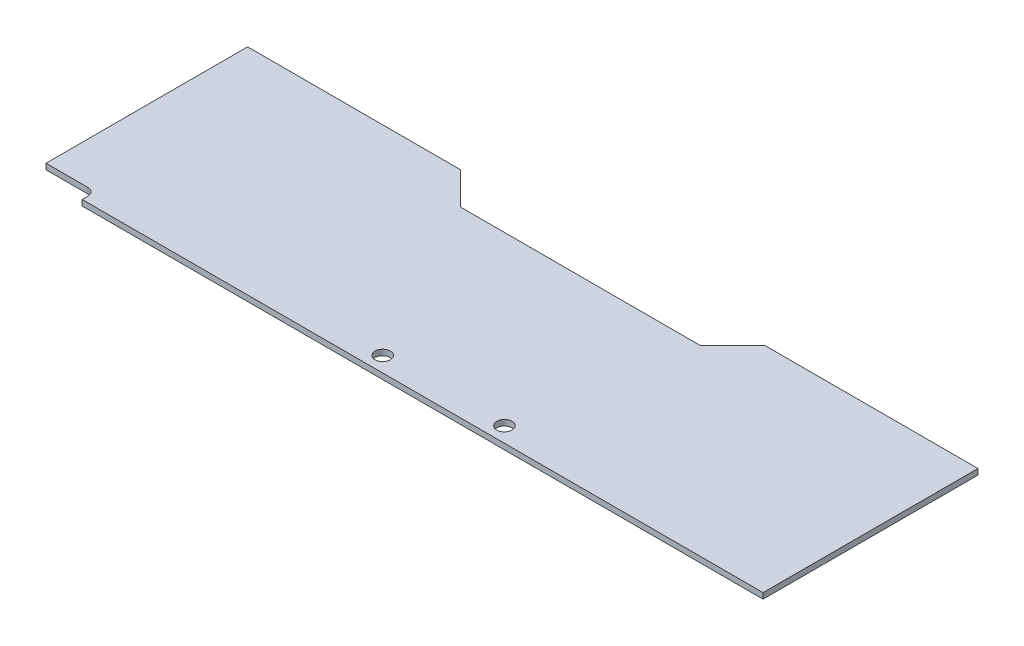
ISO-10303-21;
HEADER;
FILE_DESCRIPTION(('STEP AP214'),'2;1');
FILE_NAME('part.step','',(''),(''),'','','');
FILE_SCHEMA(('AUTOMOTIVE_DESIGN { 1 0 10303 214 1 1 1 1 }'));
ENDSEC;
DATA;
#1=APPLICATION_CONTEXT('core data for automotive mechanical design processes');
#2=APPLICATION_PROTOCOL_DEFINITION('international standard','automotive_design',2000,#1);
#3=PRODUCT_CONTEXT('',#1,'mechanical');
#4=PRODUCT('Part','Part','',(#3));
#5=PRODUCT_RELATED_PRODUCT_CATEGORY('part','',(#4));
#6=PRODUCT_DEFINITION_FORMATION('','',#4);
#7=PRODUCT_DEFINITION_CONTEXT('part definition',#1,'design');
#8=PRODUCT_DEFINITION('design','',#6,#7);
#9=PRODUCT_DEFINITION_SHAPE('','',#8);
#10=(LENGTH_UNIT() NAMED_UNIT(*) SI_UNIT(.MILLI.,.METRE.));
#11=(NAMED_UNIT(*) PLANE_ANGLE_UNIT() SI_UNIT($,.RADIAN.));
#12=(NAMED_UNIT(*) SI_UNIT($,.STERADIAN.) SOLID_ANGLE_UNIT());
#13=UNCERTAINTY_MEASURE_WITH_UNIT(LENGTH_MEASURE(1.E-05),#10,'distance_accuracy_value','');
#14=(GEOMETRIC_REPRESENTATION_CONTEXT(3) GLOBAL_UNCERTAINTY_ASSIGNED_CONTEXT((#13)) GLOBAL_UNIT_ASSIGNED_CONTEXT((#10,
#11,#12)) REPRESENTATION_CONTEXT('',''));
#15=CARTESIAN_POINT('',(0.,0.,0.));
#16=DIRECTION('',(0.,0.,1.));
#17=DIRECTION('',(1.,0.,0.));
#18=AXIS2_PLACEMENT_3D('',#15,#16,#17);
#19=CARTESIAN_POINT('',(1219.2,19.05,358.775));
#20=DIRECTION('',(0.,0.,-1.));
#21=DIRECTION('',(-1.,0.,0.));
#22=AXIS2_PLACEMENT_3D('',#19,#20,#21);
#23=PLANE('',#22);
#24=DIRECTION('',(1.,0.,0.));
#25=VECTOR('',#24,1.);
#26=CARTESIAN_POINT('',(1219.2,0.,358.775));
#27=LINE('',#26,#25);
#28=CARTESIAN_POINT('',(-1054.1,0.,358.775));
#29=VERTEX_POINT('',#28);
#30=CARTESIAN_POINT('',(1219.2,0.,358.775));
#31=VERTEX_POINT('',#30);
#32=EDGE_CURVE('E153',#29,#31,#27,.T.);
#33=ORIENTED_EDGE('',*,*,#32,.T.);
#34=DIRECTION('',(0.,-1.,0.));
#35=VECTOR('',#34,1.);
#36=CARTESIAN_POINT('',(1219.2,19.05,358.775));
#37=LINE('',#36,#35);
#38=CARTESIAN_POINT('',(1219.2,19.05,358.775));
#39=VERTEX_POINT('',#38);
#40=EDGE_CURVE('E11',#39,#31,#37,.T.);
#41=ORIENTED_EDGE('',*,*,#40,.F.);
#42=DIRECTION('',(1.,0.,0.));
#43=VECTOR('',#42,1.);
#44=CARTESIAN_POINT('',(1219.2,19.05,358.775));
#45=LINE('',#44,#43);
#46=CARTESIAN_POINT('',(-1054.1,19.05,358.775));
#47=VERTEX_POINT('',#46);
#48=EDGE_CURVE('E174',#47,#39,#45,.T.);
#49=ORIENTED_EDGE('',*,*,#48,.F.);
#50=DIRECTION('',(0.,-1.,0.));
#51=VECTOR('',#50,1.);
#52=CARTESIAN_POINT('',(-1054.1,19.05,358.775));
#53=LINE('',#52,#51);
#54=EDGE_CURVE('E149',#47,#29,#53,.T.);
#55=ORIENTED_EDGE('',*,*,#54,.T.);
#56=EDGE_LOOP('',(#33,#41,#49,#55));
#57=FACE_BOUND('',#56,.T.);
#58=ADVANCED_FACE('F39',(#57),#23,.F.);
#59=CARTESIAN_POINT('',(1219.2,19.05,-358.775));
#60=DIRECTION('',(-1.,0.,0.));
#61=DIRECTION('',(0.,0.,1.));
#62=AXIS2_PLACEMENT_3D('',#59,#60,#61);
#63=PLANE('',#62);
#64=DIRECTION('',(0.,0.,-1.));
#65=VECTOR('',#64,1.);
#66=CARTESIAN_POINT('',(1219.2,0.,-358.775));
#67=LINE('',#66,#65);
#68=CARTESIAN_POINT('',(1219.2,0.,-358.775));
#69=VERTEX_POINT('',#68);
#70=EDGE_CURVE('E156',#31,#69,#67,.T.);
#71=ORIENTED_EDGE('',*,*,#70,.T.);
#72=DIRECTION('',(0.,-1.,0.));
#73=VECTOR('',#72,1.);
#74=CARTESIAN_POINT('',(1219.2,19.05,-358.775));
#75=LINE('',#74,#73);
#76=CARTESIAN_POINT('',(1219.2,19.05,-358.775));
#77=VERTEX_POINT('',#76);
#78=EDGE_CURVE('E47',#77,#69,#75,.T.);
#79=ORIENTED_EDGE('',*,*,#78,.F.);
#80=DIRECTION('',(0.,0.,-1.));
#81=VECTOR('',#80,1.);
#82=CARTESIAN_POINT('',(1219.2,19.05,-358.775));
#83=LINE('',#82,#81);
#84=EDGE_CURVE('E107',#39,#77,#83,.T.);
#85=ORIENTED_EDGE('',*,*,#84,.F.);
#86=ORIENTED_EDGE('',*,*,#40,.T.);
#87=EDGE_LOOP('',(#71,#79,#85,#86));
#88=FACE_BOUND('',#87,.T.);
#89=ADVANCED_FACE('F247',(#88),#63,.F.);
#90=CARTESIAN_POINT('',(508.,19.05,-358.775));
#91=DIRECTION('',(0.,0.,1.));
#92=DIRECTION('',(1.,0.,0.));
#93=AXIS2_PLACEMENT_3D('',#90,#91,#92);
#94=PLANE('',#93);
#95=DIRECTION('',(-1.,0.,0.));
#96=VECTOR('',#95,1.);
#97=CARTESIAN_POINT('',(508.,0.,-358.775));
#98=LINE('',#97,#96);
#99=CARTESIAN_POINT('',(508.,0.,-358.775));
#100=VERTEX_POINT('',#99);
#101=EDGE_CURVE('E159',#69,#100,#98,.T.);
#102=ORIENTED_EDGE('',*,*,#101,.T.);
#103=DIRECTION('',(0.,-1.,0.));
#104=VECTOR('',#103,1.);
#105=CARTESIAN_POINT('',(508.,19.05,-358.775));
#106=LINE('',#105,#104);
#107=CARTESIAN_POINT('',(508.,19.05,-358.775));
#108=VERTEX_POINT('',#107);
#109=EDGE_CURVE('E190',#108,#100,#106,.T.);
#110=ORIENTED_EDGE('',*,*,#109,.F.);
#111=DIRECTION('',(-1.,0.,0.));
#112=VECTOR('',#111,1.);
#113=CARTESIAN_POINT('',(508.,19.05,-358.775));
#114=LINE('',#113,#112);
#115=EDGE_CURVE('E198',#77,#108,#114,.T.);
#116=ORIENTED_EDGE('',*,*,#115,.F.);
#117=ORIENTED_EDGE('',*,*,#78,.T.);
#118=EDGE_LOOP('',(#102,#110,#116,#117));
#119=FACE_BOUND('',#118,.T.);
#120=ADVANCED_FACE('F196',(#119),#94,.F.);
#121=CARTESIAN_POINT('',(400.05,19.05,-250.825));
#122=DIRECTION('',(0.707106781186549,0.,0.707106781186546));
#123=DIRECTION('',(0.707106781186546,0.,-0.707106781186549));
#124=AXIS2_PLACEMENT_3D('',#121,#122,#123);
#125=PLANE('',#124);
#126=DIRECTION('',(-0.707106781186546,0.,0.707106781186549));
#127=VECTOR('',#126,1.);
#128=CARTESIAN_POINT('',(400.05,0.,-250.825));
#129=LINE('',#128,#127);
#130=CARTESIAN_POINT('',(400.05,0.,-250.825));
#131=VERTEX_POINT('',#130);
#132=EDGE_CURVE('E161',#100,#131,#129,.T.);
#133=ORIENTED_EDGE('',*,*,#132,.T.);
#134=DIRECTION('',(0.,-1.,0.));
#135=VECTOR('',#134,1.);
#136=CARTESIAN_POINT('',(400.05,19.05,-250.825));
#137=LINE('',#136,#135);
#138=CARTESIAN_POINT('',(400.05,19.05,-250.825));
#139=VERTEX_POINT('',#138);
#140=EDGE_CURVE('E187',#139,#131,#137,.T.);
#141=ORIENTED_EDGE('',*,*,#140,.F.);
#142=DIRECTION('',(-0.707106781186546,0.,0.707106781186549));
#143=VECTOR('',#142,1.);
#144=CARTESIAN_POINT('',(400.05,19.05,-250.825));
#145=LINE('',#144,#143);
#146=EDGE_CURVE('E216',#108,#139,#145,.T.);
#147=ORIENTED_EDGE('',*,*,#146,.F.);
#148=ORIENTED_EDGE('',*,*,#109,.T.);
#149=EDGE_LOOP('',(#133,#141,#147,#148));
#150=FACE_BOUND('',#149,.T.);
#151=ADVANCED_FACE('F207',(#150),#125,.F.);
#152=CARTESIAN_POINT('',(-400.05,19.05,-250.825));
#153=DIRECTION('',(0.,0.,1.));
#154=DIRECTION('',(1.,0.,0.));
#155=AXIS2_PLACEMENT_3D('',#152,#153,#154);
#156=PLANE('',#155);
#157=DIRECTION('',(-1.,0.,0.));
#158=VECTOR('',#157,1.);
#159=CARTESIAN_POINT('',(-400.05,0.,-250.825));
#160=LINE('',#159,#158);
#161=CARTESIAN_POINT('',(-400.05,0.,-250.825));
#162=VERTEX_POINT('',#161);
#163=EDGE_CURVE('E163',#131,#162,#160,.T.);
#164=ORIENTED_EDGE('',*,*,#163,.T.);
#165=DIRECTION('',(0.,-1.,0.));
#166=VECTOR('',#165,1.);
#167=CARTESIAN_POINT('',(-400.05,19.05,-250.825));
#168=LINE('',#167,#166);
#169=CARTESIAN_POINT('',(-400.05,19.05,-250.825));
#170=VERTEX_POINT('',#169);
#171=EDGE_CURVE('E184',#170,#162,#168,.T.);
#172=ORIENTED_EDGE('',*,*,#171,.F.);
#173=DIRECTION('',(-1.,0.,0.));
#174=VECTOR('',#173,1.);
#175=CARTESIAN_POINT('',(-400.05,19.05,-250.825));
#176=LINE('',#175,#174);
#177=EDGE_CURVE('E213',#139,#170,#176,.T.);
#178=ORIENTED_EDGE('',*,*,#177,.F.);
#179=ORIENTED_EDGE('',*,*,#140,.T.);
#180=EDGE_LOOP('',(#164,#172,#178,#179));
#181=FACE_BOUND('',#180,.T.);
#182=ADVANCED_FACE('F211',(#181),#156,.F.);
#183=CARTESIAN_POINT('',(-508.,19.05,-358.775));
#184=DIRECTION('',(-0.707106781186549,0.,0.707106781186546));
#185=DIRECTION('',(0.707106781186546,0.,0.707106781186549));
#186=AXIS2_PLACEMENT_3D('',#183,#184,#185);
#187=PLANE('',#186);
#188=DIRECTION('',(-0.707106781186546,0.,-0.707106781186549));
#189=VECTOR('',#188,1.);
#190=CARTESIAN_POINT('',(-508.,0.,-358.775));
#191=LINE('',#190,#189);
#192=CARTESIAN_POINT('',(-508.,0.,-358.775));
#193=VERTEX_POINT('',#192);
#194=EDGE_CURVE('E165',#162,#193,#191,.T.);
#195=ORIENTED_EDGE('',*,*,#194,.T.);
#196=DIRECTION('',(0.,-1.,0.));
#197=VECTOR('',#196,1.);
#198=CARTESIAN_POINT('',(-508.,19.05,-358.775));
#199=LINE('',#198,#197);
#200=CARTESIAN_POINT('',(-508.,19.05,-358.775));
#201=VERTEX_POINT('',#200);
#202=EDGE_CURVE('E181',#201,#193,#199,.T.);
#203=ORIENTED_EDGE('',*,*,#202,.F.);
#204=DIRECTION('',(-0.707106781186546,0.,-0.707106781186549));
#205=VECTOR('',#204,1.);
#206=CARTESIAN_POINT('',(-508.,19.05,-358.775));
#207=LINE('',#206,#205);
#208=EDGE_CURVE('E215',#170,#201,#207,.T.);
#209=ORIENTED_EDGE('',*,*,#208,.F.);
#210=ORIENTED_EDGE('',*,*,#171,.T.);
#211=EDGE_LOOP('',(#195,#203,#209,#210));
#212=FACE_BOUND('',#211,.T.);
#213=ADVANCED_FACE('F260',(#212),#187,.F.);
#214=CARTESIAN_POINT('',(-1219.2,19.05,-358.775));
#215=DIRECTION('',(0.,0.,1.));
#216=DIRECTION('',(1.,0.,0.));
#217=AXIS2_PLACEMENT_3D('',#214,#215,#216);
#218=PLANE('',#217);
#219=DIRECTION('',(-1.,0.,0.));
#220=VECTOR('',#219,1.);
#221=CARTESIAN_POINT('',(-1219.2,0.,-358.775));
#222=LINE('',#221,#220);
#223=CARTESIAN_POINT('',(-1219.2,0.,-358.775));
#224=VERTEX_POINT('',#223);
#225=EDGE_CURVE('E167',#193,#224,#222,.T.);
#226=ORIENTED_EDGE('',*,*,#225,.T.);
#227=DIRECTION('',(0.,-1.,0.));
#228=VECTOR('',#227,1.);
#229=CARTESIAN_POINT('',(-1219.2,19.05,-358.775));
#230=LINE('',#229,#228);
#231=CARTESIAN_POINT('',(-1219.2,19.05,-358.775));
#232=VERTEX_POINT('',#231);
#233=EDGE_CURVE('E178',#232,#224,#230,.T.);
#234=ORIENTED_EDGE('',*,*,#233,.F.);
#235=DIRECTION('',(-1.,0.,0.));
#236=VECTOR('',#235,1.);
#237=CARTESIAN_POINT('',(-1219.2,19.05,-358.775));
#238=LINE('',#237,#236);
#239=EDGE_CURVE('E218',#201,#232,#238,.T.);
#240=ORIENTED_EDGE('',*,*,#239,.F.);
#241=ORIENTED_EDGE('',*,*,#202,.T.);
#242=EDGE_LOOP('',(#226,#234,#240,#241));
#243=FACE_BOUND('',#242,.T.);
#244=ADVANCED_FACE('F227',(#243),#218,.F.);
#245=CARTESIAN_POINT('',(-1219.2,19.05,314.325));
#246=DIRECTION('',(1.,0.,0.));
#247=DIRECTION('',(0.,0.,-1.));
#248=AXIS2_PLACEMENT_3D('',#245,#246,#247);
#249=PLANE('',#248);
#250=DIRECTION('',(0.,0.,1.));
#251=VECTOR('',#250,1.);
#252=CARTESIAN_POINT('',(-1219.2,0.,314.325));
#253=LINE('',#252,#251);
#254=CARTESIAN_POINT('',(-1219.2,0.,314.325));
#255=VERTEX_POINT('',#254);
#256=EDGE_CURVE('E169',#224,#255,#253,.T.);
#257=ORIENTED_EDGE('',*,*,#256,.T.);
#258=DIRECTION('',(0.,-1.,0.));
#259=VECTOR('',#258,1.);
#260=CARTESIAN_POINT('',(-1219.2,19.05,314.325));
#261=LINE('',#260,#259);
#262=CARTESIAN_POINT('',(-1219.2,19.05,314.325));
#263=VERTEX_POINT('',#262);
#264=EDGE_CURVE('E144',#263,#255,#261,.T.);
#265=ORIENTED_EDGE('',*,*,#264,.F.);
#266=DIRECTION('',(0.,0.,1.));
#267=VECTOR('',#266,1.);
#268=CARTESIAN_POINT('',(-1219.2,19.05,314.325));
#269=LINE('',#268,#267);
#270=EDGE_CURVE('E135',#232,#263,#269,.T.);
#271=ORIENTED_EDGE('',*,*,#270,.F.);
#272=ORIENTED_EDGE('',*,*,#233,.T.);
#273=EDGE_LOOP('',(#257,#265,#271,#272));
#274=FACE_BOUND('',#273,.T.);
#275=ADVANCED_FACE('F231',(#274),#249,.F.);
#276=CARTESIAN_POINT('',(-1219.2,19.05,314.325));
#277=DIRECTION('',(0.,0.,-1.));
#278=DIRECTION('',(-1.,0.,0.));
#279=AXIS2_PLACEMENT_3D('',#276,#277,#278);
#280=PLANE('',#279);
#281=DIRECTION('',(1.,0.,0.));
#282=VECTOR('',#281,1.);
#283=CARTESIAN_POINT('',(-1219.2,0.,314.325));
#284=LINE('',#283,#282);
#285=CARTESIAN_POINT('',(-1079.5,0.,314.325));
#286=VERTEX_POINT('',#285);
#287=EDGE_CURVE('E143',#255,#286,#284,.T.);
#288=ORIENTED_EDGE('',*,*,#287,.T.);
#289=DIRECTION('',(0.,-1.,0.));
#290=VECTOR('',#289,1.);
#291=CARTESIAN_POINT('',(-1079.5,19.05,314.325));
#292=LINE('',#291,#290);
#293=CARTESIAN_POINT('',(-1079.5,19.05,314.325));
#294=VERTEX_POINT('',#293);
#295=EDGE_CURVE('E140',#294,#286,#292,.T.);
#296=ORIENTED_EDGE('',*,*,#295,.F.);
#297=DIRECTION('',(1.,0.,0.));
#298=VECTOR('',#297,1.);
#299=CARTESIAN_POINT('',(-1219.2,19.05,314.325));
#300=LINE('',#299,#298);
#301=EDGE_CURVE('E129',#263,#294,#300,.T.);
#302=ORIENTED_EDGE('',*,*,#301,.F.);
#303=ORIENTED_EDGE('',*,*,#264,.T.);
#304=EDGE_LOOP('',(#288,#296,#302,#303));
#305=FACE_BOUND('',#304,.T.);
#306=ADVANCED_FACE('F141',(#305),#280,.F.);
#307=CARTESIAN_POINT('',(-1079.5,19.05,339.725));
#308=DIRECTION('',(0.,-1.,0.));
#309=DIRECTION('',(0.,0.,-1.));
#310=AXIS2_PLACEMENT_3D('',#307,#308,#309);
#311=CYLINDRICAL_SURFACE('',#310,25.4);
#312=CARTESIAN_POINT('',(-1079.5,0.,339.725));
#313=DIRECTION('',(0.,-1.,0.));
#314=DIRECTION('',(0.,0.,1.));
#315=AXIS2_PLACEMENT_3D('',#312,#313,#314);
#316=CIRCLE('',#315,25.4);
#317=CARTESIAN_POINT('',(-1054.1,0.,339.725));
#318=VERTEX_POINT('',#317);
#319=EDGE_CURVE('E93',#286,#318,#316,.T.);
#320=ORIENTED_EDGE('',*,*,#319,.T.);
#321=DIRECTION('',(0.,-1.,0.));
#322=VECTOR('',#321,1.);
#323=CARTESIAN_POINT('',(-1054.1,19.05,339.725));
#324=LINE('',#323,#322);
#325=CARTESIAN_POINT('',(-1054.1,19.05,339.725));
#326=VERTEX_POINT('',#325);
#327=EDGE_CURVE('E145',#326,#318,#324,.T.);
#328=ORIENTED_EDGE('',*,*,#327,.F.);
#329=CARTESIAN_POINT('',(-1079.5,19.05,339.725));
#330=DIRECTION('',(0.,-1.,0.));
#331=DIRECTION('',(0.,0.,1.));
#332=AXIS2_PLACEMENT_3D('',#329,#330,#331);
#333=CIRCLE('',#332,25.4);
#334=EDGE_CURVE('E133',#294,#326,#333,.T.);
#335=ORIENTED_EDGE('',*,*,#334,.F.);
#336=ORIENTED_EDGE('',*,*,#295,.T.);
#337=EDGE_LOOP('',(#320,#328,#335,#336));
#338=FACE_BOUND('',#337,.T.);
#339=ADVANCED_FACE('F147',(#338),#311,.F.);
#340=CARTESIAN_POINT('',(-1054.1,19.05,358.775));
#341=DIRECTION('',(1.,0.,0.));
#342=DIRECTION('',(0.,0.,-1.));
#343=AXIS2_PLACEMENT_3D('',#340,#341,#342);
#344=PLANE('',#343);
#345=DIRECTION('',(0.,0.,1.));
#346=VECTOR('',#345,1.);
#347=CARTESIAN_POINT('',(-1054.1,0.,358.775));
#348=LINE('',#347,#346);
#349=EDGE_CURVE('E99',#318,#29,#348,.T.);
#350=ORIENTED_EDGE('',*,*,#349,.T.);
#351=ORIENTED_EDGE('',*,*,#54,.F.);
#352=DIRECTION('',(0.,0.,1.));
#353=VECTOR('',#352,1.);
#354=CARTESIAN_POINT('',(-1054.1,19.05,358.775));
#355=LINE('',#354,#353);
#356=EDGE_CURVE('E55',#326,#47,#355,.T.);
#357=ORIENTED_EDGE('',*,*,#356,.F.);
#358=ORIENTED_EDGE('',*,*,#327,.T.);
#359=EDGE_LOOP('',(#350,#351,#357,#358));
#360=FACE_BOUND('',#359,.T.);
#361=ADVANCED_FACE('F235',(#360),#344,.F.);
#362=CARTESIAN_POINT('',(-1079.5,19.05,339.725));
#363=DIRECTION('',(0.,1.,0.));
#364=DIRECTION('',(0.,0.,1.));
#365=AXIS2_PLACEMENT_3D('',#362,#363,#364);
#366=PLANE('',#365);
#367=CARTESIAN_POINT('',(-101.6,19.05,307.975));
#368=DIRECTION('',(0.,1.,0.));
#369=DIRECTION('',(0.,0.,1.));
#370=AXIS2_PLACEMENT_3D('',#367,#368,#369);
#371=CIRCLE('',#370,25.4);
#372=CARTESIAN_POINT('',(-101.6,19.05,333.375));
#373=VERTEX_POINT('',#372);
#374=EDGE_CURVE('E324',#373,#373,#371,.T.);
#375=ORIENTED_EDGE('',*,*,#374,.F.);
#376=EDGE_LOOP('',(#375));
#377=FACE_BOUND('',#376,.T.);
#378=CARTESIAN_POINT('',(304.8,19.05,307.975));
#379=DIRECTION('',(0.,1.,0.));
#380=DIRECTION('',(0.,0.,1.));
#381=AXIS2_PLACEMENT_3D('',#378,#379,#380);
#382=CIRCLE('',#381,25.4);
#383=CARTESIAN_POINT('',(304.8,19.05,333.375));
#384=VERTEX_POINT('',#383);
#385=EDGE_CURVE('E329',#384,#384,#382,.T.);
#386=ORIENTED_EDGE('',*,*,#385,.F.);
#387=EDGE_LOOP('',(#386));
#388=FACE_BOUND('',#387,.T.);
#389=ORIENTED_EDGE('',*,*,#48,.T.);
#390=ORIENTED_EDGE('',*,*,#84,.T.);
#391=ORIENTED_EDGE('',*,*,#115,.T.);
#392=ORIENTED_EDGE('',*,*,#146,.T.);
#393=ORIENTED_EDGE('',*,*,#177,.T.);
#394=ORIENTED_EDGE('',*,*,#208,.T.);
#395=ORIENTED_EDGE('',*,*,#239,.T.);
#396=ORIENTED_EDGE('',*,*,#270,.T.);
#397=ORIENTED_EDGE('',*,*,#301,.T.);
#398=ORIENTED_EDGE('',*,*,#334,.T.);
#399=ORIENTED_EDGE('',*,*,#356,.T.);
#400=EDGE_LOOP('',(#389,#390,#391,#392,#393,#394,#395,#396,#397,#398,#399));
#401=FACE_BOUND('',#400,.T.);
#402=ADVANCED_FACE('F131',(#377,#388,#401),#366,.T.);
#403=CARTESIAN_POINT('',(-1079.5,0.,339.725));
#404=DIRECTION('',(0.,1.,0.));
#405=DIRECTION('',(0.,0.,1.));
#406=AXIS2_PLACEMENT_3D('',#403,#404,#405);
#407=PLANE('',#406);
#408=CARTESIAN_POINT('',(-101.6,0.,307.975));
#409=DIRECTION('',(0.,1.,0.));
#410=DIRECTION('',(0.,0.,1.));
#411=AXIS2_PLACEMENT_3D('',#408,#409,#410);
#412=CIRCLE('',#411,25.4);
#413=CARTESIAN_POINT('',(-101.6,0.,333.375));
#414=VERTEX_POINT('',#413);
#415=EDGE_CURVE('E157',#414,#414,#412,.T.);
#416=ORIENTED_EDGE('',*,*,#415,.T.);
#417=EDGE_LOOP('',(#416));
#418=FACE_BOUND('',#417,.T.);
#419=CARTESIAN_POINT('',(304.8,0.,307.975));
#420=DIRECTION('',(0.,1.,0.));
#421=DIRECTION('',(0.,0.,1.));
#422=AXIS2_PLACEMENT_3D('',#419,#420,#421);
#423=CIRCLE('',#422,25.4);
#424=CARTESIAN_POINT('',(304.8,0.,333.375));
#425=VERTEX_POINT('',#424);
#426=EDGE_CURVE('E325',#425,#425,#423,.T.);
#427=ORIENTED_EDGE('',*,*,#426,.T.);
#428=EDGE_LOOP('',(#427));
#429=FACE_BOUND('',#428,.T.);
#430=ORIENTED_EDGE('',*,*,#32,.F.);
#431=ORIENTED_EDGE('',*,*,#349,.F.);
#432=ORIENTED_EDGE('',*,*,#319,.F.);
#433=ORIENTED_EDGE('',*,*,#287,.F.);
#434=ORIENTED_EDGE('',*,*,#256,.F.);
#435=ORIENTED_EDGE('',*,*,#225,.F.);
#436=ORIENTED_EDGE('',*,*,#194,.F.);
#437=ORIENTED_EDGE('',*,*,#163,.F.);
#438=ORIENTED_EDGE('',*,*,#132,.F.);
#439=ORIENTED_EDGE('',*,*,#101,.F.);
#440=ORIENTED_EDGE('',*,*,#70,.F.);
#441=EDGE_LOOP('',(#430,#431,#432,#433,#434,#435,#436,#437,#438,#439,#440));
#442=FACE_BOUND('',#441,.T.);
#443=ADVANCED_FACE('F202',(#418,#429,#442),#407,.F.);
#444=CARTESIAN_POINT('',(304.8,0.,307.975));
#445=DIRECTION('',(0.,1.,0.));
#446=DIRECTION('',(0.,0.,1.));
#447=AXIS2_PLACEMENT_3D('',#444,#445,#446);
#448=CYLINDRICAL_SURFACE('',#447,25.4);
#449=CARTESIAN_POINT('',(304.8,0.,333.375));
#450=CARTESIAN_POINT('',(304.8,0.1984375,333.375));
#451=CARTESIAN_POINT('',(304.8,0.396875,333.375));
#452=CARTESIAN_POINT('',(304.8,0.79375,333.375));
#453=CARTESIAN_POINT('',(304.8,0.9921875,333.375));
#454=CARTESIAN_POINT('',(304.8,1.3890625,333.375));
#455=CARTESIAN_POINT('',(304.8,1.5875,333.375));
#456=CARTESIAN_POINT('',(304.8,1.984375,333.375));
#457=CARTESIAN_POINT('',(304.8,2.1828125,333.375));
#458=CARTESIAN_POINT('',(304.8,2.5796875,333.375));
#459=CARTESIAN_POINT('',(304.8,2.778125,333.375));
#460=CARTESIAN_POINT('',(304.8,3.175,333.375));
#461=CARTESIAN_POINT('',(304.8,3.3734375,333.375));
#462=CARTESIAN_POINT('',(304.8,3.7703125,333.375));
#463=CARTESIAN_POINT('',(304.8,3.96875,333.375));
#464=CARTESIAN_POINT('',(304.8,4.365625,333.375));
#465=CARTESIAN_POINT('',(304.8,4.5640625,333.375));
#466=CARTESIAN_POINT('',(304.8,4.9609375,333.375));
#467=CARTESIAN_POINT('',(304.8,5.159375,333.375));
#468=CARTESIAN_POINT('',(304.8,5.55625,333.375));
#469=CARTESIAN_POINT('',(304.8,5.7546875,333.375));
#470=CARTESIAN_POINT('',(304.8,6.1515625,333.375));
#471=CARTESIAN_POINT('',(304.8,6.35,333.375));
#472=CARTESIAN_POINT('',(304.8,6.746875,333.375));
#473=CARTESIAN_POINT('',(304.8,6.9453125,333.375));
#474=CARTESIAN_POINT('',(304.8,7.3421875,333.375));
#475=CARTESIAN_POINT('',(304.8,7.540625,333.375));
#476=CARTESIAN_POINT('',(304.8,7.9375,333.375));
#477=CARTESIAN_POINT('',(304.8,8.1359375,333.375));
#478=CARTESIAN_POINT('',(304.8,8.5328125,333.375));
#479=CARTESIAN_POINT('',(304.8,8.73125,333.375));
#480=CARTESIAN_POINT('',(304.8,9.128125,333.375));
#481=CARTESIAN_POINT('',(304.8,9.3265625,333.375));
#482=CARTESIAN_POINT('',(304.8,9.7234375,333.375));
#483=CARTESIAN_POINT('',(304.8,9.921875,333.375));
#484=CARTESIAN_POINT('',(304.8,10.31875,333.375));
#485=CARTESIAN_POINT('',(304.8,10.5171875,333.375));
#486=CARTESIAN_POINT('',(304.8,10.9140625,333.375));
#487=CARTESIAN_POINT('',(304.8,11.1125,333.375));
#488=CARTESIAN_POINT('',(304.8,11.509375,333.375));
#489=CARTESIAN_POINT('',(304.8,11.7078125,333.375));
#490=CARTESIAN_POINT('',(304.8,12.1046875,333.375));
#491=CARTESIAN_POINT('',(304.8,12.303125,333.375));
#492=CARTESIAN_POINT('',(304.8,12.7,333.375));
#493=CARTESIAN_POINT('',(304.8,12.8984375,333.375));
#494=CARTESIAN_POINT('',(304.8,13.2953125,333.375));
#495=CARTESIAN_POINT('',(304.8,13.49375,333.375));
#496=CARTESIAN_POINT('',(304.8,13.890625,333.375));
#497=CARTESIAN_POINT('',(304.8,14.0890625,333.375));
#498=CARTESIAN_POINT('',(304.8,14.4859375,333.375));
#499=CARTESIAN_POINT('',(304.8,14.684375,333.375));
#500=CARTESIAN_POINT('',(304.8,15.08125,333.375));
#501=CARTESIAN_POINT('',(304.8,15.2796875,333.375));
#502=CARTESIAN_POINT('',(304.8,15.6765625,333.375));
#503=CARTESIAN_POINT('',(304.8,15.875,333.375));
#504=CARTESIAN_POINT('',(304.8,16.271875,333.375));
#505=CARTESIAN_POINT('',(304.8,16.4703125,333.375));
#506=CARTESIAN_POINT('',(304.8,16.8671875,333.375));
#507=CARTESIAN_POINT('',(304.8,17.065625,333.375));
#508=CARTESIAN_POINT('',(304.8,17.4625,333.375));
#509=CARTESIAN_POINT('',(304.8,17.6609375,333.375));
#510=CARTESIAN_POINT('',(304.8,18.0578125,333.375));
#511=CARTESIAN_POINT('',(304.8,18.25625,333.375));
#512=CARTESIAN_POINT('',(304.8,18.653125,333.375));
#513=CARTESIAN_POINT('',(304.8,18.8515625,333.375));
#514=CARTESIAN_POINT('',(304.8,19.05,333.375));
#515=B_SPLINE_CURVE_WITH_KNOTS('',3,(#449,#450,#451,#452,#453,#454,#455,#456,#457,#458,#459,
#460,#461,#462,#463,#464,#465,#466,#467,#468,#469,#470,#471,#472,#473,#474,#475,#476,#477,#478,
#479,#480,#481,#482,#483,#484,#485,#486,#487,#488,#489,#490,#491,#492,#493,#494,#495,#496,#497,
#498,#499,#500,#501,#502,#503,#504,#505,#506,#507,#508,#509,#510,#511,#512,#513,#514),
.UNSPECIFIED.,.F.,.F.,(4,2,2,2,2,2,2,2,2,2,2,2,2,2,2,2,2,2,2,2,2,2,2,2,2,2,2,2,2,2,2,2,4),(0.,
0.5953125,1.190625,1.7859375,2.38125,2.9765625,3.571875,4.1671875,4.7625,5.3578125,5.953125,
6.5484375,7.14375,7.7390625,8.334375,8.9296875,9.525,10.1203125,10.715625,11.3109375,11.90625,
12.5015625,13.096875,13.6921875,14.2875,14.8828125,15.478125,16.0734375,16.66875,17.2640625,
17.859375,18.4546875,19.05),.UNSPECIFIED.);
#516=EDGE_CURVE('BSEAM296',#425,#384,#515,.T.);
#517=ORIENTED_EDGE('',*,*,#426,.F.);
#518=ORIENTED_EDGE('',*,*,#385,.T.);
#519=ORIENTED_EDGE('',*,*,#516,.T.);
#520=ORIENTED_EDGE('',*,*,#516,.F.);
#521=EDGE_LOOP('',(#517,#519,#518,#520));
#522=FACE_BOUND('',#521,.T.);
#523=ADVANCED_FACE('F296',(#522),#448,.F.);
#524=CARTESIAN_POINT('',(-101.6,0.,307.975));
#525=DIRECTION('',(0.,1.,0.));
#526=DIRECTION('',(0.,0.,1.));
#527=AXIS2_PLACEMENT_3D('',#524,#525,#526);
#528=CYLINDRICAL_SURFACE('',#527,25.4);
#529=CARTESIAN_POINT('',(-101.6,0.,333.375));
#530=CARTESIAN_POINT('',(-101.6,0.1984375,333.375));
#531=CARTESIAN_POINT('',(-101.6,0.396875,333.375));
#532=CARTESIAN_POINT('',(-101.6,0.79375,333.375));
#533=CARTESIAN_POINT('',(-101.6,0.9921875,333.375));
#534=CARTESIAN_POINT('',(-101.6,1.3890625,333.375));
#535=CARTESIAN_POINT('',(-101.6,1.5875,333.375));
#536=CARTESIAN_POINT('',(-101.6,1.984375,333.375));
#537=CARTESIAN_POINT('',(-101.6,2.1828125,333.375));
#538=CARTESIAN_POINT('',(-101.6,2.5796875,333.375));
#539=CARTESIAN_POINT('',(-101.6,2.778125,333.375));
#540=CARTESIAN_POINT('',(-101.6,3.175,333.375));
#541=CARTESIAN_POINT('',(-101.6,3.3734375,333.375));
#542=CARTESIAN_POINT('',(-101.6,3.7703125,333.375));
#543=CARTESIAN_POINT('',(-101.6,3.96875,333.375));
#544=CARTESIAN_POINT('',(-101.6,4.365625,333.375));
#545=CARTESIAN_POINT('',(-101.6,4.5640625,333.375));
#546=CARTESIAN_POINT('',(-101.6,4.9609375,333.375));
#547=CARTESIAN_POINT('',(-101.6,5.159375,333.375));
#548=CARTESIAN_POINT('',(-101.6,5.55625,333.375));
#549=CARTESIAN_POINT('',(-101.6,5.7546875,333.375));
#550=CARTESIAN_POINT('',(-101.6,6.1515625,333.375));
#551=CARTESIAN_POINT('',(-101.6,6.35,333.375));
#552=CARTESIAN_POINT('',(-101.6,6.746875,333.375));
#553=CARTESIAN_POINT('',(-101.6,6.9453125,333.375));
#554=CARTESIAN_POINT('',(-101.6,7.3421875,333.375));
#555=CARTESIAN_POINT('',(-101.6,7.540625,333.375));
#556=CARTESIAN_POINT('',(-101.6,7.9375,333.375));
#557=CARTESIAN_POINT('',(-101.6,8.1359375,333.375));
#558=CARTESIAN_POINT('',(-101.6,8.5328125,333.375));
#559=CARTESIAN_POINT('',(-101.6,8.73125,333.375));
#560=CARTESIAN_POINT('',(-101.6,9.128125,333.375));
#561=CARTESIAN_POINT('',(-101.6,9.3265625,333.375));
#562=CARTESIAN_POINT('',(-101.6,9.7234375,333.375));
#563=CARTESIAN_POINT('',(-101.6,9.921875,333.375));
#564=CARTESIAN_POINT('',(-101.6,10.31875,333.375));
#565=CARTESIAN_POINT('',(-101.6,10.5171875,333.375));
#566=CARTESIAN_POINT('',(-101.6,10.9140625,333.375));
#567=CARTESIAN_POINT('',(-101.6,11.1125,333.375));
#568=CARTESIAN_POINT('',(-101.6,11.509375,333.375));
#569=CARTESIAN_POINT('',(-101.6,11.7078125,333.375));
#570=CARTESIAN_POINT('',(-101.6,12.1046875,333.375));
#571=CARTESIAN_POINT('',(-101.6,12.303125,333.375));
#572=CARTESIAN_POINT('',(-101.6,12.7,333.375));
#573=CARTESIAN_POINT('',(-101.6,12.8984375,333.375));
#574=CARTESIAN_POINT('',(-101.6,13.2953125,333.375));
#575=CARTESIAN_POINT('',(-101.6,13.49375,333.375));
#576=CARTESIAN_POINT('',(-101.6,13.890625,333.375));
#577=CARTESIAN_POINT('',(-101.6,14.0890625,333.375));
#578=CARTESIAN_POINT('',(-101.6,14.4859375,333.375));
#579=CARTESIAN_POINT('',(-101.6,14.684375,333.375));
#580=CARTESIAN_POINT('',(-101.6,15.08125,333.375));
#581=CARTESIAN_POINT('',(-101.6,15.2796875,333.375));
#582=CARTESIAN_POINT('',(-101.6,15.6765625,333.375));
#583=CARTESIAN_POINT('',(-101.6,15.875,333.375));
#584=CARTESIAN_POINT('',(-101.6,16.271875,333.375));
#585=CARTESIAN_POINT('',(-101.6,16.4703125,333.375));
#586=CARTESIAN_POINT('',(-101.6,16.8671875,333.375));
#587=CARTESIAN_POINT('',(-101.6,17.065625,333.375));
#588=CARTESIAN_POINT('',(-101.6,17.4625,333.375));
#589=CARTESIAN_POINT('',(-101.6,17.6609375,333.375));
#590=CARTESIAN_POINT('',(-101.6,18.0578125,333.375));
#591=CARTESIAN_POINT('',(-101.6,18.25625,333.375));
#592=CARTESIAN_POINT('',(-101.6,18.653125,333.375));
#593=CARTESIAN_POINT('',(-101.6,18.8515625,333.375));
#594=CARTESIAN_POINT('',(-101.6,19.05,333.375));
#595=B_SPLINE_CURVE_WITH_KNOTS('',3,(#529,#530,#531,#532,#533,#534,#535,#536,#537,#538,#539,
#540,#541,#542,#543,#544,#545,#546,#547,#548,#549,#550,#551,#552,#553,#554,#555,#556,#557,#558,
#559,#560,#561,#562,#563,#564,#565,#566,#567,#568,#569,#570,#571,#572,#573,#574,#575,#576,#577,
#578,#579,#580,#581,#582,#583,#584,#585,#586,#587,#588,#589,#590,#591,#592,#593,#594),
.UNSPECIFIED.,.F.,.F.,(4,2,2,2,2,2,2,2,2,2,2,2,2,2,2,2,2,2,2,2,2,2,2,2,2,2,2,2,2,2,2,2,4),(0.,
0.5953125,1.190625,1.7859375,2.38125,2.9765625,3.571875,4.1671875,4.7625,5.3578125,5.953125,
6.5484375,7.14375,7.7390625,8.334375,8.9296875,9.525,10.1203125,10.715625,11.3109375,11.90625,
12.5015625,13.096875,13.6921875,14.2875,14.8828125,15.478125,16.0734375,16.66875,17.2640625,
17.859375,18.4546875,19.05),.UNSPECIFIED.);
#596=EDGE_CURVE('BSEAM305',#414,#373,#595,.T.);
#597=ORIENTED_EDGE('',*,*,#415,.F.);
#598=ORIENTED_EDGE('',*,*,#374,.T.);
#599=ORIENTED_EDGE('',*,*,#596,.T.);
#600=ORIENTED_EDGE('',*,*,#596,.F.);
#601=EDGE_LOOP('',(#597,#599,#598,#600));
#602=FACE_BOUND('',#601,.T.);
#603=ADVANCED_FACE('F305',(#602),#528,.F.);
#604=CLOSED_SHELL('',(#58,#89,#120,#151,#182,#213,#244,#275,#306,#339,#361,#402,#443,#523,#603));
#605=MANIFOLD_SOLID_BREP('B2',#604);
#606=ADVANCED_BREP_SHAPE_REPRESENTATION('',(#18,#605),#14);
#607=SHAPE_DEFINITION_REPRESENTATION(#9,#606);
ENDSEC;
END-ISO-10303-21;
